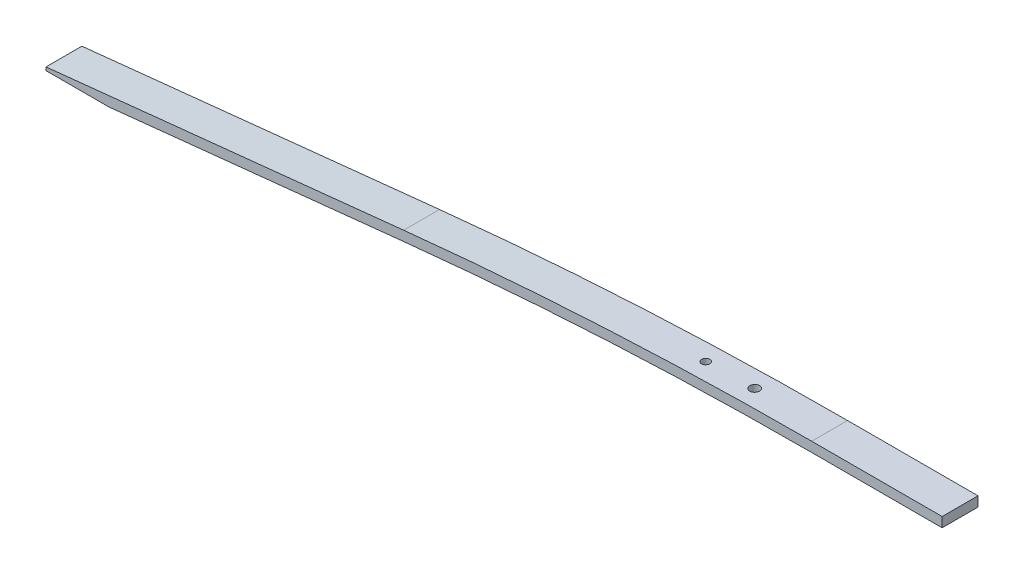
from build123d import *

# Parameters (mm, degrees)
EXTRUDE1_DEPTH     = 5.5
SKETCH2_R          = 1.5
SKETCH2_R_2        = 1.25
CUT_EXTRUDE1_DEPTH = 276.734245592


with BuildPart() as part:
    # Sketch1 → Extrude1 (new, symmetric)
    with BuildSketch(Plane.XY):
        with BuildLine():
            Line((-164.827821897, 11.989846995), (-255.561088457, 2.5))
            Line((-255.561088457, 2.5), (-274.839724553, 2.5))
            Line((-274.839724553, 2.5), (-274.839724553, 3.5))
            Line((-274.839724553, 3.5), (-165.139891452, 14.973571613))
            ThreePointArc((-165.139891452, 14.973571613), (-102.654981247, 19.86728494), (-40, 21.5))
            Line((-40, 21.5), (0, 21.5))
            Line((0, 21.5), (0, 18.5))
            Line((0, 18.5), (-40, 18.5))
            ThreePointArc((-40, 18.5), (-102.498734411, 16.871356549), (-164.827821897, 11.989846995))
        make_face()
    extrude(amount=EXTRUDE1_DEPTH, both=True)

    # Sketch2 → Cut-Extrude1 (cut, through all)
    with BuildSketch(Plane(origin=(0, 0, 0), x_dir=(1, 0, 0), z_dir=(0, 1, 0))):
        with Locations(Location((-63, 0, 0), (0, 0, 90))):
            Circle(SKETCH2_R)
        with Locations(Location((-78, 0, 0), (0, 0, 90))):
            Circle(SKETCH2_R_2)
    extrude(amount=CUT_EXTRUDE1_DEPTH, mode=Mode.SUBTRACT)


solid = part.part
